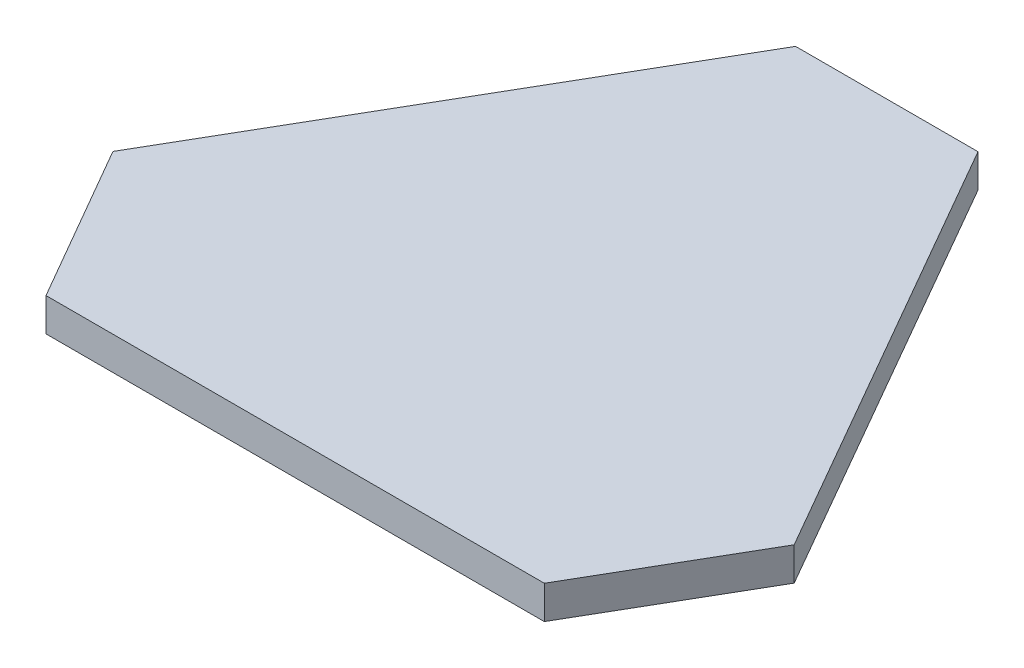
from build123d import *

# Parameters (mm, degrees)
AUFSATZ_LINEAR_AUSTRAGEN1_DEPTH = 20


with BuildPart() as part:
    # Skizze1 → Aufsatz-Linear austragen1 (new body)
    with BuildSketch(Plane(origin=(0, 0, 0), x_dir=(1, 0, 0), z_dir=(0, 1, 0))):
        Polygon((-149.988554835, 0), (150.075497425, 0), (205.218263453, 95.301404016), (55.58434216, 355.613027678), (-54.237176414, 355.613027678), (-204.994277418, 95.301404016), align=None)
    extrude(amount=AUFSATZ_LINEAR_AUSTRAGEN1_DEPTH)


solid = part.part
